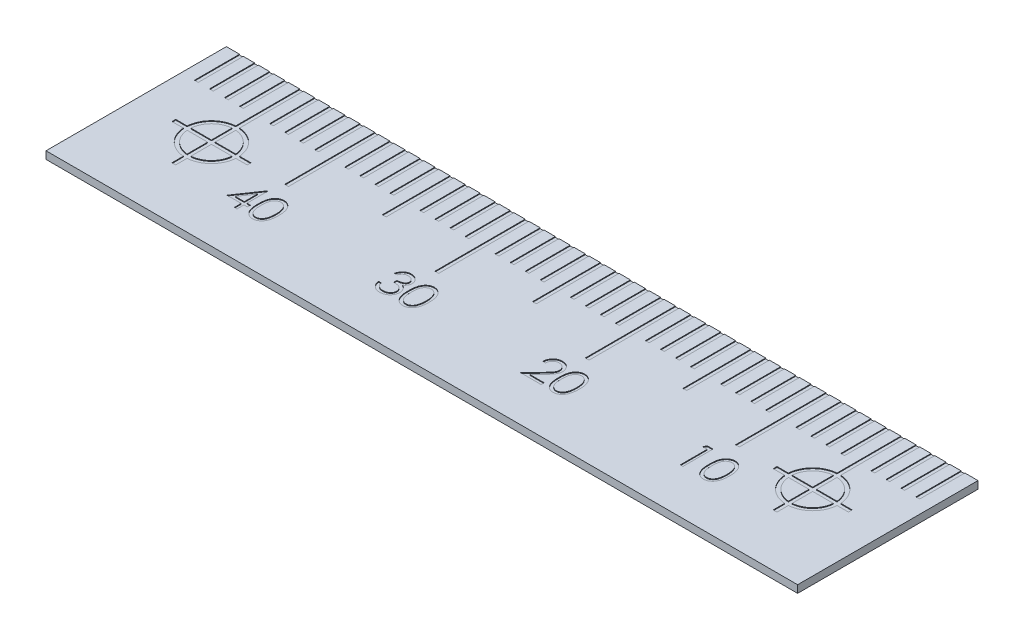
from build123d import *

# Parameters (mm, degrees)
SKETCH1_W           = 50
SKETCH1_H           = 12
BOSS_EXTRUDE1_DEPTH = 0.5
SKETCH2_W           = 0.25
SKETCH2_H           = 3
CUT_EXTRUDE2_DEPTH  = 0.05
LPATTERN2_COUNT     = 49
LPATTERN2_PITCH     = 1
SKETCH3_W           = 0.25
SKETCH3_H           = 3
CUT_EXTRUDE3_DEPTH  = 0.05
LPATTERN3_COUNT     = 4
LPATTERN3_PITCH     = 10
SKETCH4_W           = 0.25
SKETCH4_H           = 1.5
CUT_EXTRUDE4_DEPTH  = 0.05
LPATTERN4_COUNT     = 4
LPATTERN4_PITCH     = 10
LPATTERN4_COL_COUNT = 2
LPATTERN4_COL_PITCH = 10
CUT_EXTRUDE6_DEPTH  = 0.05
LPATTERN5_COUNT     = 2
LPATTERN5_PITCH     = 40
CUT_EXTRUDE12_DEPTH = 0.05


with BuildPart() as part:
    # Sketch1 → Boss-Extrude1 (new body)
    with BuildSketch(Plane(origin=(0, 0, 0), x_dir=(1, 0, 0), z_dir=(0, 1, 0))):
        Rectangle(SKETCH1_W, SKETCH1_H)
    extrude(amount=-BOSS_EXTRUDE1_DEPTH)

    # Sketch2 → Cut-Extrude2 (cut)
    with BuildSketch(Plane(origin=(0, 0, 0), x_dir=(1, 0, 0), z_dir=(0, 1, 0))):
        with Locations((-24, 4.5)):
            Rectangle(SKETCH2_W, SKETCH2_H)
    cut_extrude2 = extrude(amount=-CUT_EXTRUDE2_DEPTH, mode=Mode.SUBTRACT)

    # LPattern2: Cut-Extrude2 ×49
    with Locations(*[(i * LPATTERN2_PITCH, 0, 0) for i in range(1, LPATTERN2_COUNT)]):
        add(cut_extrude2, mode=Mode.SUBTRACT)

    # Sketch3 → Cut-Extrude3 (cut)
    with BuildSketch(Plane(origin=(0, 0, 0), x_dir=(1, 0, 0), z_dir=(0, 1, 0))):
        with Locations((-15, 1.5)):
            Rectangle(SKETCH3_W, SKETCH3_H)
    cut_extrude3 = extrude(amount=-CUT_EXTRUDE3_DEPTH, mode=Mode.SUBTRACT)

    # LPattern3: Cut-Extrude3 ×4
    with Locations(*[(i * LPATTERN3_PITCH, 0, 0) for i in range(1, LPATTERN3_COUNT)]):
        add(cut_extrude3, mode=Mode.SUBTRACT)

    # Sketch4 → Cut-Extrude4 (cut)
    with BuildSketch(Plane(origin=(0, 0, 0), x_dir=(1, 0, 0), z_dir=(0, 1, 0))):
        with Locations((-10, 2.25)):
            Rectangle(SKETCH4_W, SKETCH4_H)
    cut_extrude4 = extrude(amount=-CUT_EXTRUDE4_DEPTH, mode=Mode.SUBTRACT)

    # LPattern4: Cut-Extrude4 ×4
    with Locations(*[(i * LPATTERN4_PITCH, 0, 0) for i in range(1, LPATTERN4_COUNT)]):
        add(cut_extrude4, mode=Mode.SUBTRACT)

    # LPattern4 col: Cut-Extrude4 ×2
    with Locations(*[(-i * LPATTERN4_COL_PITCH, 0, 0) for i in range(1, LPATTERN4_COL_COUNT)]):
        add(cut_extrude4, mode=Mode.SUBTRACT)

    # Sketch5 → Cut-Extrude6 (cut)
    with BuildSketch(Plane(origin=(0, 0, 0), x_dir=(1, 0, 0), z_dir=(0, 1, 0))):
        with BuildLine():
            Line((-20.12, 2.5), (-19.87, 2.5))
            Line((-19.87, 2.5), (-19.87, 1.745530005))
            ThreePointArc((-19.87, 1.745530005), (-18.757563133, 1.237436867), (-18.249469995, 0.125))
            Line((-18.249469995, 0.125), (-17.495, 0.125))
            Line((-17.495, 0.125), (-17.495, -0.125))
            Line((-17.495, -0.125), (-18.249469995, -0.125))
            ThreePointArc((-18.249469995, -0.125), (-18.757563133, -1.237436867), (-19.87, -1.745530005))
            Line((-19.87, -1.745530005), (-19.87, -2.5))
            Line((-19.87, -2.5), (-20.12, -2.5))
            Line((-20.12, -2.5), (-20.12, -1.745530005))
            ThreePointArc((-20.12, -1.745530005), (-21.232436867, -1.237436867), (-21.740530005, -0.125))
            Line((-21.740530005, -0.125), (-22.495, -0.125))
            Line((-22.495, -0.125), (-22.495, 0.125))
            Line((-22.495, 0.125), (-21.740530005, 0.125))
            ThreePointArc((-21.740530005, 0.125), (-21.232436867, 1.237436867), (-20.12, 1.745530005))
            Line((-20.12, 1.745530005), (-20.12, 2.5))
        make_face()
        with BuildLine():
            Line((-20.12, 1.494782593), (-20.12, 0.125))
            Line((-20.12, 0.125), (-21.489782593, 0.125))
            ThreePointArc((-21.489782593, 0.125), (-21.055660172, 1.060660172), (-20.12, 1.494782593))
        make_face(mode=Mode.SUBTRACT)
        with BuildLine():
            Line((-19.87, 1.494782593), (-19.87, 0.125))
            Line((-19.87, 0.125), (-18.500217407, 0.125))
            ThreePointArc((-18.500217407, 0.125), (-18.934339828, 1.060660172), (-19.87, 1.494782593))
        make_face(mode=Mode.SUBTRACT)
        with BuildLine():
            Line((-21.489782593, -0.125), (-20.12, -0.125))
            Line((-20.12, -0.125), (-20.12, -1.494782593))
            ThreePointArc((-20.12, -1.494782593), (-21.055660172, -1.060660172), (-21.489782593, -0.125))
        make_face(mode=Mode.SUBTRACT)
        with BuildLine():
            Line((-19.87, -0.125), (-19.87, -1.494782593))
            ThreePointArc((-19.87, -1.494782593), (-18.934339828, -1.060660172), (-18.500217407, -0.125))
            Line((-18.500217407, -0.125), (-19.87, -0.125))
        make_face(mode=Mode.SUBTRACT)
    cut_extrude6 = extrude(amount=-CUT_EXTRUDE6_DEPTH, mode=Mode.SUBTRACT)

    # LPattern5: Cut-Extrude6 ×2
    with Locations(*[(i * LPATTERN5_PITCH, 0, 0) for i in range(1, LPATTERN5_COUNT)]):
        add(cut_extrude6, mode=Mode.SUBTRACT)

    # Sketch15 → Cut-Extrude12 (cut)
    # profile 1 of 8: a face of its own
    with BuildSketch(Plane(origin=(0, 0, 0), x_dir=(1, 0, 0), z_dir=(0, 1, 0))):
        Polygon((-15.331330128, -0.948717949), (-15.294871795, -0.948717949), (-15.294871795, -2.333333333), (-15.064102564, -2.333333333), (-15.064102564, -2.538461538), (-15.294871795, -2.538461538), (-15.294871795, -3), (-15.474358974, -3), (-15.474358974, -2.538461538), (-16.423076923, -2.538461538), align=None)
        Polygon((-15.474358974, -2.333333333), (-15.474358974, -1.46474359), (-16.070512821, -2.333333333), align=None, mode=Mode.SUBTRACT)
    # profile 2 of 8: a face of its own
    with BuildSketch(Plane(origin=(0, 0, 0), x_dir=(1, 0, 0), z_dir=(0, 1, 0))):
        with BuildLine():
            add(Edge.make_bspline(
                [(-14.884615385, -2.000801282), (-14.884427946, -1.968745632), (-14.884063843, -1.906477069), (-14.880013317, -1.815742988), (-14.87328455, -1.730622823), (-14.864063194, -1.6511125), (-14.852841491, -1.577191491), (-14.837861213, -1.509057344), (-14.820825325, -1.446394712), (-14.801081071, -1.388999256), (-14.778802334, -1.336097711), (-14.754554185, -1.286711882), (-14.727374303, -1.240916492), (-14.698816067, -1.197980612), (-14.667723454, -1.158607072), (-14.634981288, -1.122239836), (-14.599311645, -1.089719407), (-14.561927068, -1.060092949), (-14.522489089, -1.034121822), (-14.482121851, -1.011245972), (-14.440547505, -0.99170319), (-14.397652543, -0.976337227), (-14.35382251, -0.963645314), (-14.308904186, -0.954965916), (-14.262823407, -0.949504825), (-14.23171973, -0.948982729), (-14.215945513, -0.948717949)],
                knots=[0, 0, 0, 0, 1.646270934, 3.197905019, 4.663502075, 6.030701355, 7.308322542, 8.50163776, 9.611534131, 10.641858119, 11.616356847, 12.558055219, 13.465016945, 14.349605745, 15.204443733, 16.039544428, 16.859896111, 17.680448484, 18.487036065, 19.28249412, 20.06191084, 20.843045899, 21.620316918, 22.403196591, 23.190181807, 24, 24, 24, 24], degree=3))
            add(Edge.make_bspline(
                [(-14.215945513, -0.948717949), (-14.200039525, -0.9489967), (-14.16840752, -0.949551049), (-14.121641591, -0.954879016), (-14.075956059, -0.963719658), (-14.031545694, -0.976245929), (-13.988045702, -0.991786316), (-13.945796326, -1.011264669), (-13.904535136, -1.033938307), (-13.864917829, -1.060580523), (-13.826509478, -1.090284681), (-13.790253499, -1.123863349), (-13.756146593, -1.160977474), (-13.723760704, -1.201229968), (-13.694014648, -1.245392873), (-13.665686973, -1.292698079), (-13.640331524, -1.343972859), (-13.615911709, -1.398361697), (-13.594833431, -1.457369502), (-13.575824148, -1.520663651), (-13.560464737, -1.588991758), (-13.547670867, -1.661995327), (-13.537759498, -1.73994246), (-13.530540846, -1.822666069), (-13.526727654, -1.910220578), (-13.526009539, -1.970082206), (-13.525641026, -2.000801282)],
                knots=[0, 0, 0, 0, 0.810914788, 1.612654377, 2.396697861, 3.181598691, 3.963628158, 4.749916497, 5.551656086, 6.361998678, 7.18212741, 8.025565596, 8.878627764, 9.750805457, 10.657531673, 11.591944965, 12.560506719, 13.57287815, 14.630710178, 15.753379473, 16.941251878, 18.199788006, 19.531962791, 20.947069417, 22.433333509, 24, 24, 24, 24], degree=3))
            add(Edge.make_bspline(
                [(-13.525641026, -2.000801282), (-13.52601336, -2.031386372), (-13.526738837, -2.090980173), (-13.530498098, -2.178140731), (-13.53790303, -2.260425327), (-13.547165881, -2.338031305), (-13.559995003, -2.410635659), (-13.575769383, -2.47848963), (-13.593283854, -2.541886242), (-13.614903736, -2.600306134), (-13.638566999, -2.654564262), (-13.664312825, -2.705231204), (-13.691895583, -2.752754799), (-13.721946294, -2.796754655), (-13.753976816, -2.837542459), (-13.788672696, -2.874398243), (-13.825055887, -2.908210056), (-13.863577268, -2.9382967), (-13.90381244, -2.964630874), (-13.944931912, -2.988181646), (-13.987665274, -3.007171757), (-14.031044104, -3.023477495), (-14.075688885, -3.035934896), (-14.121543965, -3.044548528), (-14.1683761, -3.050589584), (-14.200034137, -3.05105043), (-14.215945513, -3.051282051)],
                knots=[0, 0, 0, 0, 1.561518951, 3.042555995, 4.452378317, 5.7783523, 7.031515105, 8.214008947, 9.334062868, 10.386615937, 11.391082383, 12.354592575, 13.286541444, 14.194233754, 15.072674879, 15.931287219, 16.775624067, 17.606195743, 18.42308326, 19.229000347, 20.022332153, 20.807536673, 21.593273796, 22.3848459, 23.188221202, 24, 24, 24, 24], degree=3))
            add(Edge.make_bspline(
                [(-14.215945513, -3.051282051), (-14.231719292, -3.051015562), (-14.262822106, -3.050490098), (-14.308909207, -3.04505368), (-14.353642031, -3.036313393), (-14.397241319, -3.024075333), (-14.439930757, -3.009095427), (-14.481128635, -2.989579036), (-14.521293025, -2.967102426), (-14.560316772, -2.941505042), (-14.597466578, -2.912178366), (-14.632951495, -2.879741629), (-14.665880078, -2.843385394), (-14.696528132, -2.803683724), (-14.725656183, -2.761001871), (-14.75245011, -2.714757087), (-14.777233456, -2.665132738), (-14.799886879, -2.611808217), (-14.819971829, -2.554005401), (-14.837713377, -2.491063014), (-14.851721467, -2.422425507), (-14.863711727, -2.348644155), (-14.873382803, -2.269401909), (-14.879985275, -2.18465575), (-14.884066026, -2.094458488), (-14.884428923, -2.032590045), (-14.884615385, -2.000801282)],
                knots=[0, 0, 0, 0, 0.810891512, 1.598919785, 2.382837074, 3.152667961, 3.926044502, 4.706494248, 5.493654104, 6.291793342, 7.103789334, 7.925228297, 8.761435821, 9.622817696, 10.50288917, 11.416980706, 12.369136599, 13.353924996, 14.394355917, 15.514179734, 16.714354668, 17.994756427, 19.357759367, 20.818452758, 22.365282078, 24, 24, 24, 24], degree=3))
        make_face()
        with BuildLine():
            add(Edge.make_bspline(
                [(-14.705128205, -2), (-14.70505995, -2.026713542), (-14.704927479, -2.078559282), (-14.701466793, -2.153898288), (-14.696752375, -2.224167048), (-14.690671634, -2.289454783), (-14.681641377, -2.349540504), (-14.671523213, -2.404837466), (-14.659210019, -2.45505303), (-14.644641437, -2.500531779), (-14.628047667, -2.542045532), (-14.609930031, -2.580674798), (-14.590466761, -2.616875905), (-14.568684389, -2.650323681), (-14.544961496, -2.681127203), (-14.519833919, -2.709831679), (-14.492363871, -2.735429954), (-14.454361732, -2.766131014), (-14.404192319, -2.797856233), (-14.34098063, -2.82548257), (-14.276027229, -2.842843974), (-14.231940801, -2.845051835), (-14.209935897, -2.846153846)],
                knots=[0, 0, 0, 0, 1.459021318, 2.831673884, 4.118529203, 5.306027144, 6.411944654, 7.436330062, 8.375795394, 9.233974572, 10.042671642, 10.816086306, 11.563610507, 12.285937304, 12.993564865, 13.685989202, 14.367179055, 15.041617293, 16.353048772, 17.594441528, 18.799311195, 20, 20, 20, 20], degree=3))
            add(Edge.make_bspline(
                [(-14.209935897, -2.846153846), (-14.187788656, -2.845240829), (-14.1435399, -2.843416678), (-14.078892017, -2.8258174), (-14.016131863, -2.799263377), (-13.966947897, -2.767864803), (-13.929529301, -2.7379629), (-13.902719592, -2.712468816), (-13.878112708, -2.683922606), (-13.854774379, -2.653123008), (-13.833369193, -2.619481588), (-13.813904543, -2.583160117), (-13.79614263, -2.544057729), (-13.786023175, -2.516760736), (-13.780849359, -2.502804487)],
                knots=[0, 0, 0, 0, 1.353760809, 2.704726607, 4.075137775, 5.516104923, 6.260822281, 7.007110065, 7.778089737, 8.566572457, 9.372053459, 10.217411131, 11.088608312, 12, 12, 12, 12], degree=3))
            add(Edge.make_bspline(
                [(-13.780849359, -2.502804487), (-13.774819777, -2.484958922), (-13.762577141, -2.448724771), (-13.746798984, -2.39251697), (-13.734373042, -2.333543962), (-13.723193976, -2.272158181), (-13.715563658, -2.207906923), (-13.70942205, -2.140988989), (-13.705804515, -2.071353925), (-13.705356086, -2.024042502), (-13.705128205, -2)],
                knots=[0, 0, 0, 0, 0.884706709, 1.796334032, 2.740027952, 3.714592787, 4.726048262, 5.777819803, 6.87074269, 8, 8, 8, 8], degree=3))
            add(Edge.make_bspline(
                [(-13.705128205, -2), (-13.705442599, -1.975961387), (-13.706057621, -1.928936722), (-13.708408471, -1.86006919), (-13.714479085, -1.794659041), (-13.721221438, -1.732424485), (-13.731162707, -1.673710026), (-13.741881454, -1.618024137), (-13.756282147, -1.566056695), (-13.771664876, -1.516994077), (-13.789270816, -1.471393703), (-13.808651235, -1.429042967), (-13.829349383, -1.38973741), (-13.851830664, -1.353584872), (-13.875828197, -1.320423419), (-13.901975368, -1.290917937), (-13.929235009, -1.264153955), (-13.967416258, -1.233603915), (-14.017401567, -1.202454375), (-14.07959908, -1.173788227), (-14.144325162, -1.157326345), (-14.188081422, -1.155005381), (-14.209935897, -1.153846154)],
                knots=[0, 0, 0, 0, 1.31362396, 2.569729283, 3.763502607, 4.902122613, 5.988968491, 7.01645872, 7.998833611, 8.933434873, 9.825090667, 10.667526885, 11.477055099, 12.250526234, 12.991942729, 13.710640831, 14.402115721, 15.076753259, 16.378508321, 17.609869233, 18.806226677, 20, 20, 20, 20], degree=3))
            add(Edge.make_bspline(
                [(-14.209935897, -1.153846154), (-14.232056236, -1.155006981), (-14.27633721, -1.157330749), (-14.341736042, -1.173726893), (-14.404424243, -1.202305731), (-14.454277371, -1.233707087), (-14.492485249, -1.263614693), (-14.519389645, -1.28954981), (-14.544616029, -1.317919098), (-14.567854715, -1.349005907), (-14.58962002, -1.382414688), (-14.60960917, -1.418408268), (-14.627619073, -1.457169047), (-14.644238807, -1.498664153), (-14.658851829, -1.544138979), (-14.670905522, -1.594292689), (-14.682040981, -1.64941377), (-14.689923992, -1.709824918), (-14.696931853, -1.775129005), (-14.70143548, -1.845573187), (-14.704939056, -1.921038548), (-14.705063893, -1.973152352), (-14.705128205, -2)],
                knots=[0, 0, 0, 0, 1.207732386, 2.417664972, 3.655092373, 4.956220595, 5.625982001, 6.301752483, 6.994047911, 7.697131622, 8.419323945, 9.170223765, 9.943494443, 10.752040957, 11.610060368, 12.549350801, 13.567764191, 14.679664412, 15.874934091, 17.154273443, 18.533957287, 20, 20, 20, 20], degree=3))
        make_face(mode=Mode.SUBTRACT)
    # profile 3 of 8: a face of its own
    with BuildSketch(Plane(origin=(0, 0, 0), x_dir=(1, 0, 0), z_dir=(0, 1, 0))):
        with BuildLine():
            Line((-6.166666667, -1.461538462), (-6.346153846, -1.461538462))
            add(Edge.make_bspline(
                [(-6.346153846, -1.461538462), (-6.341291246, -1.441405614), (-6.33178526, -1.402047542), (-6.311958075, -1.345814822), (-6.2903585, -1.292601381), (-6.264421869, -1.243403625), (-6.236131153, -1.197232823), (-6.203718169, -1.155136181), (-6.168678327, -1.116043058), (-6.129921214, -1.081349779), (-6.089276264, -1.049933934), (-6.046170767, -1.023148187), (-6.001471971, -1.000105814), (-5.95487018, -0.981122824), (-5.906226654, -0.966822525), (-5.855981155, -0.956447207), (-5.804002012, -0.949709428), (-5.768717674, -0.949051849), (-5.750801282, -0.948717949)],
                knots=[0, 0, 0, 0, 1.162005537, 2.271625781, 3.343758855, 4.383309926, 5.390229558, 6.379919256, 7.361854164, 8.333198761, 9.295911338, 10.242430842, 11.177959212, 12.116337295, 13.062827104, 14.020064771, 14.994644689, 16, 16, 16, 16], degree=3))
            add(Edge.make_bspline(
                [(-5.750801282, -0.948717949), (-5.724696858, -0.94950608), (-5.673057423, -0.951065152), (-5.597192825, -0.965301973), (-5.524034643, -0.98783062), (-5.454383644, -1.018958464), (-5.389687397, -1.057351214), (-5.332123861, -1.10304535), (-5.282473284, -1.155159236), (-5.240819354, -1.212720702), (-5.208205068, -1.274238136), (-5.184155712, -1.337552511), (-5.169514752, -1.402513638), (-5.167617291, -1.44637494), (-5.166666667, -1.468349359)],
                knots=[0, 0, 0, 0, 1.083050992, 2.142477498, 3.193116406, 4.255571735, 5.30263384, 6.308962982, 7.297363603, 8.282367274, 9.249857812, 10.179914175, 11.08814088, 12, 12, 12, 12], degree=3))
            add(Edge.make_bspline(
                [(-5.166666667, -1.468349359), (-5.167331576, -1.489496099), (-5.1686327, -1.530876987), (-5.179680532, -1.591289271), (-5.198272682, -1.648227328), (-5.224026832, -1.70193085), (-5.257364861, -1.75205933), (-5.297749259, -1.798725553), (-5.345465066, -1.8421365), (-5.381624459, -1.867004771), (-5.400240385, -1.879807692)],
                knots=[0, 0, 0, 0, 1.024540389, 2.004866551, 2.965041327, 3.920577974, 4.882998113, 5.874504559, 6.905732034, 8, 8, 8, 8], degree=3))
            add(Edge.make_bspline(
                [(-5.400240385, -1.879807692), (-5.378965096, -1.890080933), (-5.336812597, -1.910435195), (-5.279355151, -1.95035277), (-5.227196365, -1.996442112), (-5.198108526, -2.032409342), (-5.18349359, -2.050480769)],
                knots=[0, 0, 0, 0, 1.015518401, 2.012035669, 3.001164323, 4, 4, 4, 4], degree=3))
            add(Edge.make_bspline(
                [(-5.18349359, -2.050480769), (-5.173869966, -2.063656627), (-5.154780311, -2.08979258), (-5.131217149, -2.131813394), (-5.109840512, -2.17429996), (-5.093183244, -2.218391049), (-5.080283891, -2.263575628), (-5.071063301, -2.309931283), (-5.065335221, -2.357495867), (-5.064514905, -2.389674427), (-5.064102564, -2.405849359)],
                knots=[0, 0, 0, 0, 1.025084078, 2.033381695, 3.024893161, 4.013698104, 4.991890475, 5.976764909, 6.982997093, 8, 8, 8, 8], degree=3))
            add(Edge.make_bspline(
                [(-5.064102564, -2.405849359), (-5.065128, -2.433854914), (-5.067174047, -2.489734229), (-5.08546209, -2.572291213), (-5.113812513, -2.6529915), (-5.154073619, -2.730177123), (-5.203140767, -2.802394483), (-5.261516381, -2.867009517), (-5.328537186, -2.922551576), (-5.403283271, -2.968957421), (-5.484264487, -3.006053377), (-5.570879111, -3.031800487), (-5.661879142, -3.048569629), (-5.724283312, -3.05036784), (-5.756009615, -3.051282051)],
                knots=[0, 0, 0, 0, 0.955779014, 1.907060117, 2.875433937, 3.871313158, 4.872415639, 5.851225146, 6.836215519, 7.83643374, 8.849228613, 9.86973379, 10.916971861, 12, 12, 12, 12], degree=3))
            add(Edge.make_bspline(
                [(-5.756009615, -3.051282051), (-5.777392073, -3.050785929), (-5.819465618, -3.049809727), (-5.881319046, -3.043136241), (-5.940360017, -3.030947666), (-5.996668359, -3.014545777), (-6.050294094, -2.993750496), (-6.101073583, -2.967854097), (-6.149319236, -2.937390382), (-6.194575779, -2.90199976), (-6.236837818, -2.862410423), (-6.274982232, -2.81791956), (-6.309644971, -2.769349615), (-6.339897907, -2.71613644), (-6.367119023, -2.658967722), (-6.389508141, -2.597111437), (-6.40921418, -2.531120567), (-6.41837616, -2.485133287), (-6.423076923, -2.461538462)],
                knots=[0, 0, 0, 0, 1.048658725, 2.063410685, 3.046034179, 4.001477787, 4.936774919, 5.862367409, 6.792675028, 7.730719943, 8.675894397, 9.627829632, 10.600096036, 11.597688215, 12.626045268, 13.701542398, 14.82072376, 16, 16, 16, 16], degree=3))
            Line((-6.423076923, -2.461538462), (-6.243589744, -2.461538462))
            add(Edge.make_bspline(
                [(-6.243589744, -2.461538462), (-6.238913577, -2.476937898), (-6.229818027, -2.506891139), (-6.214335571, -2.549999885), (-6.196696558, -2.589518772), (-6.177773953, -2.625737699), (-6.157900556, -2.659013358), (-6.135663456, -2.688465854), (-6.112709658, -2.715388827), (-6.095407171, -2.730557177), (-6.086939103, -2.737980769)],
                knots=[0, 0, 0, 0, 1.198163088, 2.33053128, 3.407730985, 4.417276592, 5.372219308, 6.28897303, 7.162600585, 8, 8, 8, 8], degree=3))
            add(Edge.make_bspline(
                [(-6.086939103, -2.737980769), (-6.075741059, -2.746614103), (-6.053379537, -2.763854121), (-6.016940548, -2.785855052), (-5.978617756, -2.804918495), (-5.937580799, -2.819480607), (-5.894715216, -2.831810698), (-5.84932815, -2.839879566), (-5.801820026, -2.845415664), (-5.769381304, -2.845904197), (-5.752804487, -2.846153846)],
                knots=[0, 0, 0, 0, 0.946170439, 1.889420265, 2.845303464, 3.807233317, 4.801018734, 5.828864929, 6.890507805, 8, 8, 8, 8], degree=3))
            add(Edge.make_bspline(
                [(-5.752804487, -2.846153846), (-5.7340882, -2.8458019), (-5.697490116, -2.845113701), (-5.644087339, -2.838784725), (-5.593283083, -2.829567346), (-5.545641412, -2.815331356), (-5.500538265, -2.797742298), (-5.458605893, -2.775657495), (-5.419293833, -2.749746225), (-5.383105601, -2.720295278), (-5.350565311, -2.688054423), (-5.321914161, -2.654332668), (-5.297557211, -2.619272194), (-5.277909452, -2.582678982), (-5.262394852, -2.544704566), (-5.251833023, -2.505242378), (-5.2444893, -2.464615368), (-5.243891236, -2.436998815), (-5.243589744, -2.423076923)],
                knots=[0, 0, 0, 0, 1.217147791, 2.380027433, 3.494444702, 4.572153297, 5.609568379, 6.639424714, 7.649109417, 8.668170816, 9.669597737, 10.625200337, 11.543417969, 12.441394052, 13.322311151, 14.205496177, 15.095365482, 16, 16, 16, 16], degree=3))
            add(Edge.make_bspline(
                [(-5.243589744, -2.423076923), (-5.244464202, -2.404441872), (-5.246208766, -2.367264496), (-5.259527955, -2.312568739), (-5.281435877, -2.259869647), (-5.312105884, -2.210066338), (-5.349440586, -2.16390868), (-5.393077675, -2.122724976), (-5.44337952, -2.088742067), (-5.489676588, -2.065262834), (-5.530685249, -2.049241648), (-5.565779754, -2.03857024), (-5.605069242, -2.029533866), (-5.648078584, -2.021126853), (-5.695131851, -2.013971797), (-5.746177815, -2.008005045), (-5.801226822, -2.003230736), (-5.83933606, -2.001098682), (-5.858974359, -2)],
                knots=[0, 0, 0, 0, 1.07054697, 2.135767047, 3.216561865, 4.33974944, 5.486079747, 6.621378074, 7.775625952, 8.963672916, 9.598146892, 10.304877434, 11.070270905, 11.915000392, 12.823868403, 13.805723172, 14.86925407, 16, 16, 16, 16], degree=3))
            Line((-5.858974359, -2), (-5.858974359, -1.794871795))
            add(Edge.make_bspline(
                [(-5.858974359, -1.794871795), (-5.834230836, -1.794451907), (-5.785764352, -1.79362945), (-5.714967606, -1.783682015), (-5.647268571, -1.769921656), (-5.584167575, -1.748844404), (-5.526654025, -1.724364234), (-5.476757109, -1.695877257), (-5.435175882, -1.664211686), (-5.402112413, -1.628878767), (-5.377238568, -1.590984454), (-5.359051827, -1.551489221), (-5.348308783, -1.5100469), (-5.346874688, -1.481764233), (-5.346153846, -1.467548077)],
                knots=[0, 0, 0, 0, 1.321986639, 2.589447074, 3.816329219, 5.01088745, 6.139805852, 7.153945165, 8.075214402, 8.924034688, 9.728124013, 10.488707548, 11.240355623, 12, 12, 12, 12], degree=3))
            add(Edge.make_bspline(
                [(-5.346153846, -1.467548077), (-5.346390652, -1.457103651), (-5.346861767, -1.436324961), (-5.352803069, -1.405967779), (-5.361731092, -1.376538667), (-5.374005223, -1.348162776), (-5.390433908, -1.321036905), (-5.410094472, -1.294929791), (-5.433504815, -1.269990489), (-5.460330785, -1.246744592), (-5.48913753, -1.224590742), (-5.52070883, -1.20578295), (-5.554092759, -1.189700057), (-5.589326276, -1.176437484), (-5.626523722, -1.166460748), (-5.665510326, -1.15929741), (-5.706360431, -1.154818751), (-5.734229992, -1.154173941), (-5.748397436, -1.153846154)],
                knots=[0, 0, 0, 0, 0.884392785, 1.759457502, 2.611959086, 3.489218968, 4.37281399, 5.2945488, 6.255912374, 7.266815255, 8.301784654, 9.332968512, 10.37626691, 11.440494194, 12.520033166, 13.637162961, 14.798855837, 16, 16, 16, 16], degree=3))
            add(Edge.make_bspline(
                [(-5.748397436, -1.153846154), (-5.771169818, -1.154641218), (-5.815649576, -1.156194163), (-5.879772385, -1.169795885), (-5.939383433, -1.191497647), (-5.984948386, -1.217402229), (-6.018595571, -1.242973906), (-6.042639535, -1.265306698), (-6.066251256, -1.290125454), (-6.087877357, -1.318958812), (-6.109748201, -1.34985412), (-6.129659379, -1.384381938), (-6.149007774, -1.421641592), (-6.160666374, -1.447981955), (-6.166666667, -1.461538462)],
                knots=[0, 0, 0, 0, 1.472543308, 2.876219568, 4.221790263, 5.565193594, 6.249813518, 6.953379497, 7.687249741, 8.463570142, 9.283606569, 10.136032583, 11.040678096, 12, 12, 12, 12], degree=3))
        make_face()
    # profile 4 of 8: a face of its own
    with BuildSketch(Plane(origin=(0, 0, 0), x_dir=(1, 0, 0), z_dir=(0, 1, 0))):
        with BuildLine():
            add(Edge.make_bspline(
                [(-4.884615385, -2.000801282), (-4.884427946, -1.968745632), (-4.884063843, -1.906477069), (-4.880013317, -1.815742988), (-4.87328455, -1.730622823), (-4.864063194, -1.6511125), (-4.852841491, -1.577191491), (-4.837861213, -1.509057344), (-4.820825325, -1.446394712), (-4.801081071, -1.388999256), (-4.778802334, -1.336097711), (-4.754554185, -1.286711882), (-4.727374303, -1.240916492), (-4.698816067, -1.197980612), (-4.667723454, -1.158607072), (-4.634981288, -1.122239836), (-4.599311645, -1.089719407), (-4.561927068, -1.060092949), (-4.522489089, -1.034121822), (-4.482121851, -1.011245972), (-4.440547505, -0.99170319), (-4.397652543, -0.976337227), (-4.35382251, -0.963645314), (-4.308904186, -0.954965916), (-4.262823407, -0.949504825), (-4.23171973, -0.948982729), (-4.215945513, -0.948717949)],
                knots=[0, 0, 0, 0, 1.646270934, 3.197905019, 4.663502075, 6.030701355, 7.308322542, 8.50163776, 9.611534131, 10.641858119, 11.616356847, 12.558055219, 13.465016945, 14.349605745, 15.204443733, 16.039544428, 16.859896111, 17.680448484, 18.487036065, 19.28249412, 20.06191084, 20.843045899, 21.620316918, 22.403196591, 23.190181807, 24, 24, 24, 24], degree=3))
            add(Edge.make_bspline(
                [(-4.215945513, -0.948717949), (-4.200039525, -0.9489967), (-4.16840752, -0.949551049), (-4.121641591, -0.954879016), (-4.075956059, -0.963719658), (-4.031545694, -0.976245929), (-3.988045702, -0.991786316), (-3.945796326, -1.011264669), (-3.904535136, -1.033938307), (-3.864917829, -1.060580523), (-3.826509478, -1.090284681), (-3.790253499, -1.123863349), (-3.756146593, -1.160977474), (-3.723760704, -1.201229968), (-3.694014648, -1.245392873), (-3.665686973, -1.292698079), (-3.640331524, -1.343972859), (-3.615911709, -1.398361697), (-3.594833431, -1.457369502), (-3.575824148, -1.520663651), (-3.560464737, -1.588991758), (-3.547670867, -1.661995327), (-3.537759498, -1.73994246), (-3.530540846, -1.822666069), (-3.526727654, -1.910220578), (-3.526009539, -1.970082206), (-3.525641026, -2.000801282)],
                knots=[0, 0, 0, 0, 0.810914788, 1.612654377, 2.396697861, 3.181598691, 3.963628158, 4.749916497, 5.551656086, 6.361998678, 7.18212741, 8.025565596, 8.878627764, 9.750805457, 10.657531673, 11.591944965, 12.560506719, 13.57287815, 14.630710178, 15.753379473, 16.941251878, 18.199788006, 19.531962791, 20.947069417, 22.433333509, 24, 24, 24, 24], degree=3))
            add(Edge.make_bspline(
                [(-3.525641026, -2.000801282), (-3.52601336, -2.031386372), (-3.526738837, -2.090980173), (-3.530498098, -2.178140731), (-3.53790303, -2.260425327), (-3.547165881, -2.338031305), (-3.559995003, -2.410635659), (-3.575769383, -2.47848963), (-3.593283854, -2.541886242), (-3.614903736, -2.600306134), (-3.638566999, -2.654564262), (-3.664312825, -2.705231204), (-3.691895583, -2.752754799), (-3.721946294, -2.796754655), (-3.753976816, -2.837542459), (-3.788672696, -2.874398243), (-3.825055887, -2.908210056), (-3.863577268, -2.9382967), (-3.90381244, -2.964630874), (-3.944931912, -2.988181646), (-3.987665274, -3.007171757), (-4.031044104, -3.023477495), (-4.075688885, -3.035934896), (-4.121543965, -3.044548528), (-4.1683761, -3.050589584), (-4.200034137, -3.05105043), (-4.215945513, -3.051282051)],
                knots=[0, 0, 0, 0, 1.561518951, 3.042555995, 4.452378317, 5.7783523, 7.031515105, 8.214008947, 9.334062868, 10.386615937, 11.391082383, 12.354592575, 13.286541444, 14.194233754, 15.072674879, 15.931287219, 16.775624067, 17.606195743, 18.42308326, 19.229000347, 20.022332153, 20.807536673, 21.593273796, 22.3848459, 23.188221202, 24, 24, 24, 24], degree=3))
            add(Edge.make_bspline(
                [(-4.215945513, -3.051282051), (-4.231719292, -3.051015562), (-4.262822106, -3.050490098), (-4.308909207, -3.04505368), (-4.353642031, -3.036313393), (-4.397241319, -3.024075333), (-4.439930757, -3.009095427), (-4.481128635, -2.989579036), (-4.521293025, -2.967102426), (-4.560316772, -2.941505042), (-4.597466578, -2.912178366), (-4.632951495, -2.879741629), (-4.665880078, -2.843385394), (-4.696528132, -2.803683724), (-4.725656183, -2.761001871), (-4.75245011, -2.714757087), (-4.777233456, -2.665132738), (-4.799886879, -2.611808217), (-4.819971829, -2.554005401), (-4.837713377, -2.491063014), (-4.851721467, -2.422425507), (-4.863711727, -2.348644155), (-4.873382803, -2.269401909), (-4.879985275, -2.18465575), (-4.884066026, -2.094458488), (-4.884428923, -2.032590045), (-4.884615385, -2.000801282)],
                knots=[0, 0, 0, 0, 0.810891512, 1.598919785, 2.382837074, 3.152667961, 3.926044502, 4.706494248, 5.493654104, 6.291793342, 7.103789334, 7.925228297, 8.761435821, 9.622817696, 10.50288917, 11.416980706, 12.369136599, 13.353924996, 14.394355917, 15.514179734, 16.714354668, 17.994756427, 19.357759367, 20.818452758, 22.365282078, 24, 24, 24, 24], degree=3))
        make_face()
        with BuildLine():
            add(Edge.make_bspline(
                [(-4.705128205, -2), (-4.70505995, -2.026713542), (-4.704927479, -2.078559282), (-4.701466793, -2.153898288), (-4.696752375, -2.224167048), (-4.690671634, -2.289454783), (-4.681641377, -2.349540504), (-4.671523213, -2.404837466), (-4.659210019, -2.45505303), (-4.644641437, -2.500531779), (-4.628047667, -2.542045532), (-4.609930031, -2.580674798), (-4.590466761, -2.616875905), (-4.568684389, -2.650323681), (-4.544961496, -2.681127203), (-4.519833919, -2.709831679), (-4.492363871, -2.735429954), (-4.454361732, -2.766131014), (-4.404192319, -2.797856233), (-4.34098063, -2.82548257), (-4.276027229, -2.842843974), (-4.231940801, -2.845051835), (-4.209935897, -2.846153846)],
                knots=[0, 0, 0, 0, 1.459021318, 2.831673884, 4.118529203, 5.306027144, 6.411944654, 7.436330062, 8.375795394, 9.233974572, 10.042671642, 10.816086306, 11.563610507, 12.285937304, 12.993564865, 13.685989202, 14.367179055, 15.041617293, 16.353048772, 17.594441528, 18.799311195, 20, 20, 20, 20], degree=3))
            add(Edge.make_bspline(
                [(-4.209935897, -2.846153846), (-4.187788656, -2.845240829), (-4.1435399, -2.843416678), (-4.078892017, -2.8258174), (-4.016131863, -2.799263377), (-3.966947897, -2.767864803), (-3.929529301, -2.7379629), (-3.902719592, -2.712468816), (-3.878112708, -2.683922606), (-3.854774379, -2.653123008), (-3.833369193, -2.619481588), (-3.813904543, -2.583160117), (-3.79614263, -2.544057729), (-3.786023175, -2.516760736), (-3.780849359, -2.502804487)],
                knots=[0, 0, 0, 0, 1.353760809, 2.704726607, 4.075137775, 5.516104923, 6.260822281, 7.007110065, 7.778089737, 8.566572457, 9.372053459, 10.217411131, 11.088608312, 12, 12, 12, 12], degree=3))
            add(Edge.make_bspline(
                [(-3.780849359, -2.502804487), (-3.774819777, -2.484958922), (-3.762577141, -2.448724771), (-3.746798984, -2.39251697), (-3.734373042, -2.333543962), (-3.723193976, -2.272158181), (-3.715563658, -2.207906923), (-3.70942205, -2.140988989), (-3.705804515, -2.071353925), (-3.705356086, -2.024042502), (-3.705128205, -2)],
                knots=[0, 0, 0, 0, 0.884706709, 1.796334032, 2.740027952, 3.714592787, 4.726048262, 5.777819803, 6.87074269, 8, 8, 8, 8], degree=3))
            add(Edge.make_bspline(
                [(-3.705128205, -2), (-3.705442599, -1.975961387), (-3.706057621, -1.928936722), (-3.708408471, -1.86006919), (-3.714479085, -1.794659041), (-3.721221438, -1.732424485), (-3.731162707, -1.673710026), (-3.741881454, -1.618024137), (-3.756282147, -1.566056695), (-3.771664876, -1.516994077), (-3.789270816, -1.471393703), (-3.808651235, -1.429042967), (-3.829349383, -1.38973741), (-3.851830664, -1.353584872), (-3.875828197, -1.320423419), (-3.901975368, -1.290917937), (-3.929235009, -1.264153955), (-3.967416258, -1.233603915), (-4.017401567, -1.202454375), (-4.07959908, -1.173788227), (-4.144325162, -1.157326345), (-4.188081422, -1.155005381), (-4.209935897, -1.153846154)],
                knots=[0, 0, 0, 0, 1.31362396, 2.569729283, 3.763502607, 4.902122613, 5.988968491, 7.01645872, 7.998833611, 8.933434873, 9.825090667, 10.667526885, 11.477055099, 12.250526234, 12.991942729, 13.710640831, 14.402115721, 15.076753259, 16.378508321, 17.609869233, 18.806226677, 20, 20, 20, 20], degree=3))
            add(Edge.make_bspline(
                [(-4.209935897, -1.153846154), (-4.232056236, -1.155006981), (-4.27633721, -1.157330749), (-4.341736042, -1.173726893), (-4.404424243, -1.202305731), (-4.454277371, -1.233707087), (-4.492485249, -1.263614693), (-4.519389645, -1.28954981), (-4.544616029, -1.317919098), (-4.567854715, -1.349005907), (-4.58962002, -1.382414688), (-4.60960917, -1.418408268), (-4.627619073, -1.457169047), (-4.644238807, -1.498664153), (-4.658851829, -1.544138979), (-4.670905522, -1.594292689), (-4.682040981, -1.64941377), (-4.689923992, -1.709824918), (-4.696931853, -1.775129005), (-4.70143548, -1.845573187), (-4.704939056, -1.921038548), (-4.705063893, -1.973152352), (-4.705128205, -2)],
                knots=[0, 0, 0, 0, 1.207732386, 2.417664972, 3.655092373, 4.956220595, 5.625982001, 6.301752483, 6.994047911, 7.697131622, 8.419323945, 9.170223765, 9.943494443, 10.752040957, 11.610060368, 12.549350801, 13.567764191, 14.679664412, 15.874934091, 17.154273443, 18.533957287, 20, 20, 20, 20], degree=3))
        make_face(mode=Mode.SUBTRACT)
    # profile 5 of 8: a face of its own
    with BuildSketch(Plane(origin=(0, 0, 0), x_dir=(1, 0, 0), z_dir=(0, 1, 0))):
        with BuildLine():
            Line((3.833333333, -1.615384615), (3.653846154, -1.615384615))
            add(Edge.make_bspline(
                [(3.653846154, -1.615384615), (3.655015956, -1.59157268), (3.657313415, -1.544806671), (3.668072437, -1.476621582), (3.683467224, -1.411447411), (3.70523377, -1.34980746), (3.732265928, -1.291156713), (3.764683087, -1.235728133), (3.803079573, -1.183733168), (3.846626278, -1.135653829), (3.893922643, -1.091546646), (3.944954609, -1.053457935), (3.998580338, -1.021276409), (4.054637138, -0.994372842), (4.11375746, -0.974178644), (4.175404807, -0.95919485), (4.239850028, -0.950179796), (4.283758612, -0.949210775), (4.306089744, -0.948717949)],
                knots=[0, 0, 0, 0, 1.10065271, 2.161652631, 3.183658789, 4.190468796, 5.17591951, 6.163126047, 7.15150782, 8.156236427, 9.156009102, 10.134482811, 11.092018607, 12.041330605, 13.001268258, 13.972401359, 14.968799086, 16, 16, 16, 16], degree=3))
            add(Edge.make_bspline(
                [(4.306089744, -0.948717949), (4.328020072, -0.949231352), (4.371112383, -0.950240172), (4.434004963, -0.958903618), (4.493877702, -0.972472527), (4.550613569, -0.991509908), (4.603759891, -1.017101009), (4.653715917, -1.04784246), (4.70107638, -1.083396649), (4.743708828, -1.125255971), (4.782856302, -1.169943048), (4.816629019, -1.217650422), (4.845550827, -1.266924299), (4.869658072, -1.318140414), (4.887404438, -1.371781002), (4.900877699, -1.427065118), (4.908493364, -1.48456501), (4.909662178, -1.523483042), (4.91025641, -1.543269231)],
                knots=[0, 0, 0, 0, 1.111607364, 2.184268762, 3.212621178, 4.221274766, 5.211760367, 6.196651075, 7.1921475, 8.207485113, 9.220403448, 10.201281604, 11.166441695, 12.114753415, 13.065576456, 14.026450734, 14.996634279, 16, 16, 16, 16], degree=3))
            add(Edge.make_bspline(
                [(4.91025641, -1.543269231), (4.909288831, -1.571125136), (4.907370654, -1.626348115), (4.890962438, -1.707499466), (4.865335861, -1.786124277), (4.834480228, -1.849402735), (4.803353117, -1.900393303), (4.775303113, -1.94237542), (4.742466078, -1.987578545), (4.704364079, -2.035851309), (4.661785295, -2.087571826), (4.614344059, -2.142708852), (4.561702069, -2.20069272), (4.524754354, -2.240295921), (4.505608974, -2.260817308)],
                knots=[0, 0, 0, 0, 1.184426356, 2.348067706, 3.509069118, 4.696110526, 5.333549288, 6.050745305, 6.844228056, 7.710549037, 8.667450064, 9.695053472, 10.805634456, 12, 12, 12, 12], degree=3))
            Line((4.505608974, -2.260817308), (4.005208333, -2.794871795))
            Line((4.005208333, -2.794871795), (4.935897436, -2.794871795))
            Line((4.935897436, -2.794871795), (4.935897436, -3))
            Line((4.935897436, -3), (3.576923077, -3))
            Line((3.576923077, -3), (4.352564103, -2.172275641))
            add(Edge.make_bspline(
                [(4.352564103, -2.172275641), (4.371448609, -2.152562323), (4.407721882, -2.114697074), (4.459026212, -2.059415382), (4.505105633, -2.00812993), (4.546258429, -1.960937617), (4.581591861, -1.917148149), (4.612947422, -1.878179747), (4.638070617, -1.842320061), (4.665336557, -1.800753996), (4.691744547, -1.750004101), (4.714437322, -1.68798485), (4.728274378, -1.624140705), (4.729934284, -1.580996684), (4.730769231, -1.559294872)],
                knots=[0, 0, 0, 0, 1.329631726, 2.553950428, 3.673215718, 4.687767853, 5.603093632, 6.413772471, 7.123043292, 7.734684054, 8.834405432, 9.900288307, 10.943827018, 12, 12, 12, 12], degree=3))
            add(Edge.make_bspline(
                [(4.730769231, -1.559294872), (4.730405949, -1.545648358), (4.729689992, -1.518753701), (4.723371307, -1.479321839), (4.713822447, -1.441284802), (4.700139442, -1.404525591), (4.682078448, -1.36941379), (4.660093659, -1.335906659), (4.634727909, -1.303512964), (4.605384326, -1.273139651), (4.573149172, -1.245321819), (4.539095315, -1.220679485), (4.503066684, -1.200085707), (4.465215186, -1.183203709), (4.425646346, -1.169960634), (4.384283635, -1.160784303), (4.34124134, -1.155022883), (4.311850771, -1.154243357), (4.296875, -1.153846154)],
                knots=[0, 0, 0, 0, 0.991446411, 1.95395049, 2.89581595, 3.838931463, 4.798493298, 5.75982156, 6.748411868, 7.785213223, 8.824556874, 9.840280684, 10.836137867, 11.835679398, 12.848801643, 13.863922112, 14.911575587, 16, 16, 16, 16], degree=3))
            add(Edge.make_bspline(
                [(4.296875, -1.153846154), (4.281234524, -1.154254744), (4.250519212, -1.155057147), (4.205422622, -1.160670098), (4.162402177, -1.170353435), (4.121349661, -1.183597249), (4.082195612, -1.200430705), (4.045130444, -1.221397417), (4.010237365, -1.246416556), (3.97745078, -1.274782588), (3.947242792, -1.306364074), (3.92070172, -1.341569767), (3.897510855, -1.379756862), (3.877277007, -1.420822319), (3.860845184, -1.465138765), (3.848289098, -1.512548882), (3.838353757, -1.562846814), (3.835034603, -1.597581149), (3.833333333, -1.615384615)],
                knots=[0, 0, 0, 0, 1.031018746, 2.02475058, 2.990194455, 3.934040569, 4.864654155, 5.795059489, 6.735614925, 7.690564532, 8.649604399, 9.611025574, 10.590972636, 11.591080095, 12.624614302, 13.701020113, 14.821632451, 16, 16, 16, 16], degree=3))
        make_face()
    # profile 6 of 8: a face of its own
    with BuildSketch(Plane(origin=(0, 0, 0), x_dir=(1, 0, 0), z_dir=(0, 1, 0))):
        with BuildLine():
            add(Edge.make_bspline(
                [(5.115384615, -2.000801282), (5.115572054, -1.968745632), (5.115936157, -1.906477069), (5.119986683, -1.815742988), (5.12671545, -1.730622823), (5.135936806, -1.6511125), (5.147158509, -1.577191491), (5.162138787, -1.509057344), (5.179174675, -1.446394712), (5.198918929, -1.388999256), (5.221197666, -1.336097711), (5.245445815, -1.286711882), (5.272625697, -1.240916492), (5.301183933, -1.197980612), (5.332276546, -1.158607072), (5.365018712, -1.122239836), (5.400688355, -1.089719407), (5.438072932, -1.060092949), (5.477510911, -1.034121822), (5.517878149, -1.011245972), (5.559452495, -0.99170319), (5.602347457, -0.976337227), (5.64617749, -0.963645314), (5.691095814, -0.954965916), (5.737176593, -0.949504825), (5.76828027, -0.948982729), (5.784054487, -0.948717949)],
                knots=[0, 0, 0, 0, 1.646270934, 3.197905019, 4.663502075, 6.030701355, 7.308322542, 8.50163776, 9.611534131, 10.641858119, 11.616356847, 12.558055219, 13.465016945, 14.349605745, 15.204443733, 16.039544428, 16.859896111, 17.680448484, 18.487036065, 19.28249412, 20.06191084, 20.843045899, 21.620316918, 22.403196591, 23.190181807, 24, 24, 24, 24], degree=3))
            add(Edge.make_bspline(
                [(5.784054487, -0.948717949), (5.799960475, -0.9489967), (5.83159248, -0.949551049), (5.878358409, -0.954879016), (5.924043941, -0.963719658), (5.968454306, -0.976245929), (6.011954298, -0.991786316), (6.054203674, -1.011264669), (6.095464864, -1.033938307), (6.135082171, -1.060580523), (6.173490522, -1.090284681), (6.209746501, -1.123863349), (6.243853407, -1.160977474), (6.276239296, -1.201229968), (6.305985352, -1.245392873), (6.334313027, -1.292698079), (6.359668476, -1.343972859), (6.384088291, -1.398361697), (6.405166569, -1.457369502), (6.424175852, -1.520663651), (6.439535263, -1.588991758), (6.452329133, -1.661995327), (6.462240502, -1.73994246), (6.469459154, -1.822666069), (6.473272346, -1.910220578), (6.473990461, -1.970082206), (6.474358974, -2.000801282)],
                knots=[0, 0, 0, 0, 0.810914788, 1.612654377, 2.396697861, 3.181598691, 3.963628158, 4.749916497, 5.551656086, 6.361998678, 7.18212741, 8.025565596, 8.878627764, 9.750805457, 10.657531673, 11.591944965, 12.560506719, 13.57287815, 14.630710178, 15.753379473, 16.941251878, 18.199788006, 19.531962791, 20.947069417, 22.433333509, 24, 24, 24, 24], degree=3))
            add(Edge.make_bspline(
                [(6.474358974, -2.000801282), (6.47398664, -2.031386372), (6.473261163, -2.090980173), (6.469501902, -2.178140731), (6.46209697, -2.260425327), (6.452834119, -2.338031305), (6.440004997, -2.410635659), (6.424230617, -2.47848963), (6.406716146, -2.541886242), (6.385096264, -2.600306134), (6.361433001, -2.654564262), (6.335687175, -2.705231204), (6.308104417, -2.752754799), (6.278053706, -2.796754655), (6.246023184, -2.837542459), (6.211327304, -2.874398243), (6.174944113, -2.908210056), (6.136422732, -2.9382967), (6.09618756, -2.964630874), (6.055068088, -2.988181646), (6.012334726, -3.007171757), (5.968955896, -3.023477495), (5.924311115, -3.035934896), (5.878456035, -3.044548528), (5.8316239, -3.050589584), (5.799965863, -3.05105043), (5.784054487, -3.051282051)],
                knots=[0, 0, 0, 0, 1.561518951, 3.042555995, 4.452378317, 5.7783523, 7.031515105, 8.214008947, 9.334062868, 10.386615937, 11.391082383, 12.354592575, 13.286541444, 14.194233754, 15.072674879, 15.931287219, 16.775624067, 17.606195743, 18.42308326, 19.229000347, 20.022332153, 20.807536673, 21.593273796, 22.3848459, 23.188221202, 24, 24, 24, 24], degree=3))
            add(Edge.make_bspline(
                [(5.784054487, -3.051282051), (5.768280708, -3.051015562), (5.737177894, -3.050490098), (5.691090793, -3.04505368), (5.646357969, -3.036313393), (5.602758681, -3.024075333), (5.560069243, -3.009095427), (5.518871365, -2.989579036), (5.478706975, -2.967102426), (5.439683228, -2.941505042), (5.402533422, -2.912178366), (5.367048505, -2.879741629), (5.334119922, -2.843385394), (5.303471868, -2.803683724), (5.274343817, -2.761001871), (5.24754989, -2.714757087), (5.222766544, -2.665132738), (5.200113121, -2.611808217), (5.180028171, -2.554005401), (5.162286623, -2.491063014), (5.148278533, -2.422425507), (5.136288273, -2.348644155), (5.126617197, -2.269401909), (5.120014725, -2.18465575), (5.115933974, -2.094458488), (5.115571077, -2.032590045), (5.115384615, -2.000801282)],
                knots=[0, 0, 0, 0, 0.810891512, 1.598919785, 2.382837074, 3.152667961, 3.926044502, 4.706494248, 5.493654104, 6.291793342, 7.103789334, 7.925228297, 8.761435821, 9.622817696, 10.50288917, 11.416980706, 12.369136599, 13.353924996, 14.394355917, 15.514179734, 16.714354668, 17.994756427, 19.357759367, 20.818452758, 22.365282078, 24, 24, 24, 24], degree=3))
        make_face()
        with BuildLine():
            add(Edge.make_bspline(
                [(5.294871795, -2), (5.29494005, -2.026713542), (5.295072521, -2.078559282), (5.298533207, -2.153898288), (5.303247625, -2.224167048), (5.309328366, -2.289454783), (5.318358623, -2.349540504), (5.328476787, -2.404837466), (5.340789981, -2.45505303), (5.355358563, -2.500531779), (5.371952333, -2.542045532), (5.390069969, -2.580674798), (5.409533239, -2.616875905), (5.431315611, -2.650323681), (5.455038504, -2.681127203), (5.480166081, -2.709831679), (5.507636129, -2.735429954), (5.545638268, -2.766131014), (5.595807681, -2.797856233), (5.65901937, -2.82548257), (5.723972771, -2.842843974), (5.768059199, -2.845051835), (5.790064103, -2.846153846)],
                knots=[0, 0, 0, 0, 1.459021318, 2.831673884, 4.118529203, 5.306027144, 6.411944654, 7.436330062, 8.375795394, 9.233974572, 10.042671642, 10.816086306, 11.563610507, 12.285937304, 12.993564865, 13.685989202, 14.367179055, 15.041617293, 16.353048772, 17.594441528, 18.799311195, 20, 20, 20, 20], degree=3))
            add(Edge.make_bspline(
                [(5.790064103, -2.846153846), (5.812211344, -2.845240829), (5.8564601, -2.843416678), (5.921107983, -2.8258174), (5.983868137, -2.799263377), (6.033052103, -2.767864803), (6.070470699, -2.7379629), (6.097280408, -2.712468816), (6.121887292, -2.683922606), (6.145225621, -2.653123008), (6.166630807, -2.619481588), (6.186095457, -2.583160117), (6.20385737, -2.544057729), (6.213976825, -2.516760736), (6.219150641, -2.502804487)],
                knots=[0, 0, 0, 0, 1.353760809, 2.704726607, 4.075137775, 5.516104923, 6.260822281, 7.007110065, 7.778089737, 8.566572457, 9.372053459, 10.217411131, 11.088608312, 12, 12, 12, 12], degree=3))
            add(Edge.make_bspline(
                [(6.219150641, -2.502804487), (6.225180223, -2.484958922), (6.237422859, -2.448724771), (6.253201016, -2.39251697), (6.265626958, -2.333543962), (6.276806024, -2.272158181), (6.284436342, -2.207906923), (6.29057795, -2.140988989), (6.294195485, -2.071353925), (6.294643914, -2.024042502), (6.294871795, -2)],
                knots=[0, 0, 0, 0, 0.884706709, 1.796334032, 2.740027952, 3.714592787, 4.726048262, 5.777819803, 6.87074269, 8, 8, 8, 8], degree=3))
            add(Edge.make_bspline(
                [(6.294871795, -2), (6.294557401, -1.975961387), (6.293942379, -1.928936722), (6.291591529, -1.86006919), (6.285520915, -1.794659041), (6.278778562, -1.732424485), (6.268837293, -1.673710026), (6.258118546, -1.618024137), (6.243717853, -1.566056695), (6.228335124, -1.516994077), (6.210729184, -1.471393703), (6.191348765, -1.429042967), (6.170650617, -1.38973741), (6.148169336, -1.353584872), (6.124171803, -1.320423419), (6.098024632, -1.290917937), (6.070764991, -1.264153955), (6.032583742, -1.233603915), (5.982598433, -1.202454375), (5.92040092, -1.173788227), (5.855674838, -1.157326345), (5.811918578, -1.155005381), (5.790064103, -1.153846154)],
                knots=[0, 0, 0, 0, 1.31362396, 2.569729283, 3.763502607, 4.902122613, 5.988968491, 7.01645872, 7.998833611, 8.933434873, 9.825090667, 10.667526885, 11.477055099, 12.250526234, 12.991942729, 13.710640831, 14.402115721, 15.076753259, 16.378508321, 17.609869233, 18.806226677, 20, 20, 20, 20], degree=3))
            add(Edge.make_bspline(
                [(5.790064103, -1.153846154), (5.767943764, -1.155006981), (5.72366279, -1.157330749), (5.658263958, -1.173726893), (5.595575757, -1.202305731), (5.545722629, -1.233707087), (5.507514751, -1.263614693), (5.480610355, -1.28954981), (5.455383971, -1.317919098), (5.432145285, -1.349005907), (5.41037998, -1.382414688), (5.39039083, -1.418408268), (5.372380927, -1.457169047), (5.355761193, -1.498664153), (5.341148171, -1.544138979), (5.329094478, -1.594292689), (5.317959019, -1.64941377), (5.310076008, -1.709824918), (5.303068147, -1.775129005), (5.29856452, -1.845573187), (5.295060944, -1.921038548), (5.294936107, -1.973152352), (5.294871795, -2)],
                knots=[0, 0, 0, 0, 1.207732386, 2.417664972, 3.655092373, 4.956220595, 5.625982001, 6.301752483, 6.994047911, 7.697131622, 8.419323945, 9.170223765, 9.943494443, 10.752040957, 11.610060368, 12.549350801, 13.567764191, 14.679664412, 15.874934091, 17.154273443, 18.533957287, 20, 20, 20, 20], degree=3))
        make_face(mode=Mode.SUBTRACT)
    # profile 7 of 8: a face of its own
    with BuildSketch(Plane(origin=(0, 0, 0), x_dir=(1, 0, 0), z_dir=(0, 1, 0))):
        Polygon((14.002003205, -1), (14.371794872, -1), (14.371794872, -3), (14.192307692, -3), (14.192307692, -1.205128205), (13.884615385, -1.205128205), align=None)
    # profile 8 of 8: a face of its own
    with BuildSketch(Plane(origin=(0, 0, 0), x_dir=(1, 0, 0), z_dir=(0, 1, 0))):
        with BuildLine():
            add(Edge.make_bspline(
                [(15.115384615, -2.000801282), (15.115572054, -1.968745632), (15.115936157, -1.906477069), (15.119986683, -1.815742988), (15.12671545, -1.730622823), (15.135936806, -1.6511125), (15.147158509, -1.577191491), (15.162138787, -1.509057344), (15.179174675, -1.446394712), (15.198918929, -1.388999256), (15.221197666, -1.336097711), (15.245445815, -1.286711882), (15.272625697, -1.240916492), (15.301183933, -1.197980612), (15.332276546, -1.158607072), (15.365018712, -1.122239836), (15.400688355, -1.089719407), (15.438072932, -1.060092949), (15.477510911, -1.034121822), (15.517878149, -1.011245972), (15.559452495, -0.99170319), (15.602347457, -0.976337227), (15.64617749, -0.963645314), (15.691095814, -0.954965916), (15.737176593, -0.949504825), (15.76828027, -0.948982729), (15.784054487, -0.948717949)],
                knots=[0, 0, 0, 0, 1.646270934, 3.197905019, 4.663502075, 6.030701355, 7.308322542, 8.50163776, 9.611534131, 10.641858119, 11.616356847, 12.558055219, 13.465016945, 14.349605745, 15.204443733, 16.039544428, 16.859896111, 17.680448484, 18.487036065, 19.28249412, 20.06191084, 20.843045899, 21.620316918, 22.403196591, 23.190181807, 24, 24, 24, 24], degree=3))
            add(Edge.make_bspline(
                [(15.784054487, -0.948717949), (15.799960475, -0.9489967), (15.83159248, -0.949551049), (15.878358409, -0.954879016), (15.924043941, -0.963719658), (15.968454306, -0.976245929), (16.011954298, -0.991786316), (16.054203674, -1.011264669), (16.095464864, -1.033938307), (16.135082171, -1.060580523), (16.173490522, -1.090284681), (16.209746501, -1.123863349), (16.243853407, -1.160977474), (16.276239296, -1.201229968), (16.305985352, -1.245392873), (16.334313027, -1.292698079), (16.359668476, -1.343972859), (16.384088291, -1.398361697), (16.405166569, -1.457369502), (16.424175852, -1.520663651), (16.439535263, -1.588991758), (16.452329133, -1.661995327), (16.462240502, -1.73994246), (16.469459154, -1.822666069), (16.473272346, -1.910220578), (16.473990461, -1.970082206), (16.474358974, -2.000801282)],
                knots=[0, 0, 0, 0, 0.810914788, 1.612654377, 2.396697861, 3.181598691, 3.963628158, 4.749916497, 5.551656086, 6.361998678, 7.18212741, 8.025565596, 8.878627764, 9.750805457, 10.657531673, 11.591944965, 12.560506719, 13.57287815, 14.630710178, 15.753379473, 16.941251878, 18.199788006, 19.531962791, 20.947069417, 22.433333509, 24, 24, 24, 24], degree=3))
            add(Edge.make_bspline(
                [(16.474358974, -2.000801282), (16.47398664, -2.031386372), (16.473261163, -2.090980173), (16.469501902, -2.178140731), (16.46209697, -2.260425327), (16.452834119, -2.338031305), (16.440004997, -2.410635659), (16.424230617, -2.47848963), (16.406716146, -2.541886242), (16.385096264, -2.600306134), (16.361433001, -2.654564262), (16.335687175, -2.705231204), (16.308104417, -2.752754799), (16.278053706, -2.796754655), (16.246023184, -2.837542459), (16.211327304, -2.874398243), (16.174944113, -2.908210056), (16.136422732, -2.9382967), (16.09618756, -2.964630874), (16.055068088, -2.988181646), (16.012334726, -3.007171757), (15.968955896, -3.023477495), (15.924311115, -3.035934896), (15.878456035, -3.044548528), (15.8316239, -3.050589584), (15.799965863, -3.05105043), (15.784054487, -3.051282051)],
                knots=[0, 0, 0, 0, 1.561518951, 3.042555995, 4.452378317, 5.7783523, 7.031515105, 8.214008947, 9.334062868, 10.386615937, 11.391082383, 12.354592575, 13.286541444, 14.194233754, 15.072674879, 15.931287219, 16.775624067, 17.606195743, 18.42308326, 19.229000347, 20.022332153, 20.807536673, 21.593273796, 22.3848459, 23.188221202, 24, 24, 24, 24], degree=3))
            add(Edge.make_bspline(
                [(15.784054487, -3.051282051), (15.768280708, -3.051015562), (15.737177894, -3.050490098), (15.691090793, -3.04505368), (15.646357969, -3.036313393), (15.602758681, -3.024075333), (15.560069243, -3.009095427), (15.518871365, -2.989579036), (15.478706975, -2.967102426), (15.439683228, -2.941505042), (15.402533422, -2.912178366), (15.367048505, -2.879741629), (15.334119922, -2.843385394), (15.303471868, -2.803683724), (15.274343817, -2.761001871), (15.24754989, -2.714757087), (15.222766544, -2.665132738), (15.200113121, -2.611808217), (15.180028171, -2.554005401), (15.162286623, -2.491063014), (15.148278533, -2.422425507), (15.136288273, -2.348644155), (15.126617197, -2.269401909), (15.120014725, -2.18465575), (15.115933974, -2.094458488), (15.115571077, -2.032590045), (15.115384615, -2.000801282)],
                knots=[0, 0, 0, 0, 0.810891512, 1.598919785, 2.382837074, 3.152667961, 3.926044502, 4.706494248, 5.493654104, 6.291793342, 7.103789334, 7.925228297, 8.761435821, 9.622817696, 10.50288917, 11.416980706, 12.369136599, 13.353924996, 14.394355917, 15.514179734, 16.714354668, 17.994756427, 19.357759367, 20.818452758, 22.365282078, 24, 24, 24, 24], degree=3))
        make_face()
        with BuildLine():
            add(Edge.make_bspline(
                [(15.294871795, -2), (15.29494005, -2.026713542), (15.295072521, -2.078559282), (15.298533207, -2.153898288), (15.303247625, -2.224167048), (15.309328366, -2.289454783), (15.318358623, -2.349540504), (15.328476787, -2.404837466), (15.340789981, -2.45505303), (15.355358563, -2.500531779), (15.371952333, -2.542045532), (15.390069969, -2.580674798), (15.409533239, -2.616875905), (15.431315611, -2.650323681), (15.455038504, -2.681127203), (15.480166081, -2.709831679), (15.507636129, -2.735429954), (15.545638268, -2.766131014), (15.595807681, -2.797856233), (15.65901937, -2.82548257), (15.723972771, -2.842843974), (15.768059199, -2.845051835), (15.790064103, -2.846153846)],
                knots=[0, 0, 0, 0, 1.459021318, 2.831673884, 4.118529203, 5.306027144, 6.411944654, 7.436330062, 8.375795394, 9.233974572, 10.042671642, 10.816086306, 11.563610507, 12.285937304, 12.993564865, 13.685989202, 14.367179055, 15.041617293, 16.353048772, 17.594441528, 18.799311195, 20, 20, 20, 20], degree=3))
            add(Edge.make_bspline(
                [(15.790064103, -2.846153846), (15.812211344, -2.845240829), (15.8564601, -2.843416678), (15.921107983, -2.8258174), (15.983868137, -2.799263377), (16.033052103, -2.767864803), (16.070470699, -2.7379629), (16.097280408, -2.712468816), (16.121887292, -2.683922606), (16.145225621, -2.653123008), (16.166630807, -2.619481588), (16.186095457, -2.583160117), (16.20385737, -2.544057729), (16.213976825, -2.516760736), (16.219150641, -2.502804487)],
                knots=[0, 0, 0, 0, 1.353760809, 2.704726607, 4.075137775, 5.516104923, 6.260822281, 7.007110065, 7.778089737, 8.566572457, 9.372053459, 10.217411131, 11.088608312, 12, 12, 12, 12], degree=3))
            add(Edge.make_bspline(
                [(16.219150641, -2.502804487), (16.225180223, -2.484958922), (16.237422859, -2.448724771), (16.253201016, -2.39251697), (16.265626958, -2.333543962), (16.276806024, -2.272158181), (16.284436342, -2.207906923), (16.29057795, -2.140988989), (16.294195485, -2.071353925), (16.294643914, -2.024042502), (16.294871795, -2)],
                knots=[0, 0, 0, 0, 0.884706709, 1.796334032, 2.740027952, 3.714592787, 4.726048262, 5.777819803, 6.87074269, 8, 8, 8, 8], degree=3))
            add(Edge.make_bspline(
                [(16.294871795, -2), (16.294557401, -1.975961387), (16.293942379, -1.928936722), (16.291591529, -1.86006919), (16.285520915, -1.794659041), (16.278778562, -1.732424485), (16.268837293, -1.673710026), (16.258118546, -1.618024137), (16.243717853, -1.566056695), (16.228335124, -1.516994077), (16.210729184, -1.471393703), (16.191348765, -1.429042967), (16.170650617, -1.38973741), (16.148169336, -1.353584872), (16.124171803, -1.320423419), (16.098024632, -1.290917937), (16.070764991, -1.264153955), (16.032583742, -1.233603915), (15.982598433, -1.202454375), (15.92040092, -1.173788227), (15.855674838, -1.157326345), (15.811918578, -1.155005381), (15.790064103, -1.153846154)],
                knots=[0, 0, 0, 0, 1.31362396, 2.569729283, 3.763502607, 4.902122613, 5.988968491, 7.01645872, 7.998833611, 8.933434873, 9.825090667, 10.667526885, 11.477055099, 12.250526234, 12.991942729, 13.710640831, 14.402115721, 15.076753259, 16.378508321, 17.609869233, 18.806226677, 20, 20, 20, 20], degree=3))
            add(Edge.make_bspline(
                [(15.790064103, -1.153846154), (15.767943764, -1.155006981), (15.72366279, -1.157330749), (15.658263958, -1.173726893), (15.595575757, -1.202305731), (15.545722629, -1.233707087), (15.507514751, -1.263614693), (15.480610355, -1.28954981), (15.455383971, -1.317919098), (15.432145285, -1.349005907), (15.41037998, -1.382414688), (15.39039083, -1.418408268), (15.372380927, -1.457169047), (15.355761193, -1.498664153), (15.341148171, -1.544138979), (15.329094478, -1.594292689), (15.317959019, -1.64941377), (15.310076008, -1.709824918), (15.303068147, -1.775129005), (15.29856452, -1.845573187), (15.295060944, -1.921038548), (15.294936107, -1.973152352), (15.294871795, -2)],
                knots=[0, 0, 0, 0, 1.207732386, 2.417664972, 3.655092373, 4.956220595, 5.625982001, 6.301752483, 6.994047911, 7.697131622, 8.419323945, 9.170223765, 9.943494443, 10.752040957, 11.610060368, 12.549350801, 13.567764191, 14.679664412, 15.874934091, 17.154273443, 18.533957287, 20, 20, 20, 20], degree=3))
        make_face(mode=Mode.SUBTRACT)
    extrude(amount=-CUT_EXTRUDE12_DEPTH, mode=Mode.SUBTRACT)


solid = part.part
